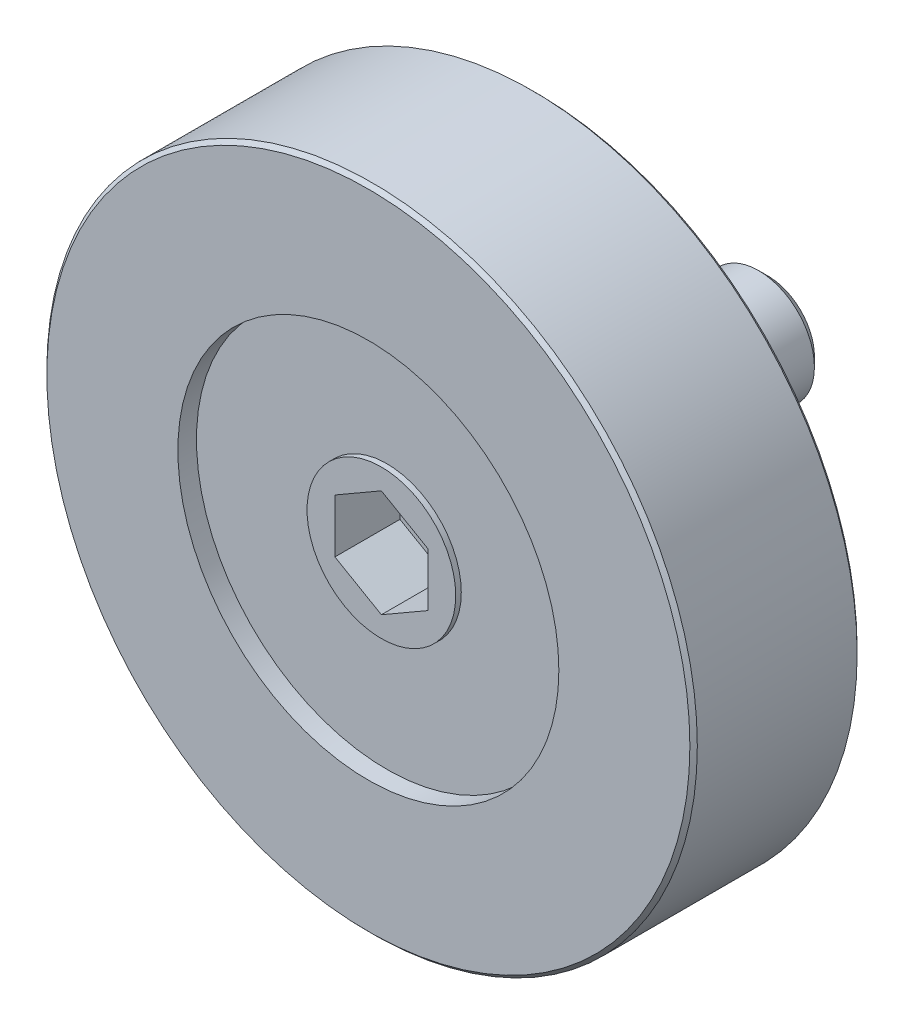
ISO-10303-21;
HEADER;
FILE_DESCRIPTION(('STEP AP214'),'2;1');
FILE_NAME('part.step','',(''),(''),'','','');
FILE_SCHEMA(('AUTOMOTIVE_DESIGN { 1 0 10303 214 1 1 1 1 }'));
ENDSEC;
DATA;
#1=APPLICATION_CONTEXT('core data for automotive mechanical design processes');
#2=APPLICATION_PROTOCOL_DEFINITION('international standard','automotive_design',2000,#1);
#3=PRODUCT_CONTEXT('',#1,'mechanical');
#4=PRODUCT('Part','Part','',(#3));
#5=PRODUCT_RELATED_PRODUCT_CATEGORY('part','',(#4));
#6=PRODUCT_DEFINITION_FORMATION('','',#4);
#7=PRODUCT_DEFINITION_CONTEXT('part definition',#1,'design');
#8=PRODUCT_DEFINITION('design','',#6,#7);
#9=PRODUCT_DEFINITION_SHAPE('','',#8);
#10=(LENGTH_UNIT() NAMED_UNIT(*) SI_UNIT(.MILLI.,.METRE.));
#11=(NAMED_UNIT(*) PLANE_ANGLE_UNIT() SI_UNIT($,.RADIAN.));
#12=(NAMED_UNIT(*) SI_UNIT($,.STERADIAN.) SOLID_ANGLE_UNIT());
#13=UNCERTAINTY_MEASURE_WITH_UNIT(LENGTH_MEASURE(1.E-05),#10,'distance_accuracy_value','');
#14=(GEOMETRIC_REPRESENTATION_CONTEXT(3) GLOBAL_UNCERTAINTY_ASSIGNED_CONTEXT((#13)) GLOBAL_UNIT_ASSIGNED_CONTEXT((#10,
#11,#12)) REPRESENTATION_CONTEXT('',''));
#15=CARTESIAN_POINT('',(0.,0.,0.));
#16=DIRECTION('',(0.,0.,1.));
#17=DIRECTION('',(1.,0.,0.));
#18=AXIS2_PLACEMENT_3D('',#15,#16,#17);
#19=CARTESIAN_POINT('',(0.,2.35,-1.5));
#20=DIRECTION('',(0.,0.,1.));
#21=DIRECTION('',(1.,0.,0.));
#22=AXIS2_PLACEMENT_3D('',#19,#20,#21);
#23=PLANE('',#22);
#24=CARTESIAN_POINT('',(0.,0.,-1.5));
#25=DIRECTION('',(0.,0.,1.));
#26=DIRECTION('',(1.,0.,0.));
#27=AXIS2_PLACEMENT_3D('',#24,#25,#26);
#28=CIRCLE('',#27,3.);
#29=CARTESIAN_POINT('',(3.,0.,-1.5));
#30=VERTEX_POINT('',#29);
#31=EDGE_CURVE('E107',#30,#30,#28,.T.);
#32=ORIENTED_EDGE('',*,*,#31,.T.);
#33=EDGE_LOOP('',(#32));
#34=FACE_BOUND('',#33,.T.);
#35=CARTESIAN_POINT('',(0.,0.,-1.5));
#36=DIRECTION('',(0.,0.,1.));
#37=DIRECTION('',(1.,0.,0.));
#38=AXIS2_PLACEMENT_3D('',#35,#36,#37);
#39=CIRCLE('',#38,2.35);
#40=CARTESIAN_POINT('',(2.35,0.,-1.5));
#41=VERTEX_POINT('',#40);
#42=EDGE_CURVE('E130',#41,#41,#39,.T.);
#43=ORIENTED_EDGE('',*,*,#42,.F.);
#44=EDGE_LOOP('',(#43));
#45=FACE_BOUND('',#44,.T.);
#46=ADVANCED_FACE('F14',(#34,#45),#23,.T.);
#47=CARTESIAN_POINT('',(0.,0.,13.5));
#48=DIRECTION('',(0.,0.,1.));
#49=DIRECTION('',(1.,0.,0.));
#50=AXIS2_PLACEMENT_3D('',#47,#48,#49);
#51=CYLINDRICAL_SURFACE('',#50,2.35);
#52=ORIENTED_EDGE('',*,*,#42,.T.);
#53=EDGE_LOOP('',(#52));
#54=FACE_BOUND('',#53,.T.);
#55=CARTESIAN_POINT('',(0.,0.,0.5));
#56=DIRECTION('',(0.,0.,1.));
#57=DIRECTION('',(1.,0.,0.));
#58=AXIS2_PLACEMENT_3D('',#55,#56,#57);
#59=CIRCLE('',#58,2.35);
#60=CARTESIAN_POINT('',(2.35,0.,0.5));
#61=VERTEX_POINT('',#60);
#62=EDGE_CURVE('E127',#61,#61,#59,.T.);
#63=ORIENTED_EDGE('',*,*,#62,.F.);
#64=EDGE_LOOP('',(#63));
#65=FACE_BOUND('',#64,.T.);
#66=ADVANCED_FACE('F161',(#54,#65),#51,.T.);
#67=CARTESIAN_POINT('',(0.,5.1,0.5));
#68=DIRECTION('',(0.,0.,-1.));
#69=DIRECTION('',(-1.,0.,0.));
#70=AXIS2_PLACEMENT_3D('',#67,#68,#69);
#71=PLANE('',#70);
#72=ORIENTED_EDGE('',*,*,#62,.T.);
#73=EDGE_LOOP('',(#72));
#74=FACE_BOUND('',#73,.T.);
#75=CARTESIAN_POINT('',(0.,0.,0.5));
#76=DIRECTION('',(0.,0.,1.));
#77=DIRECTION('',(1.,0.,0.));
#78=AXIS2_PLACEMENT_3D('',#75,#76,#77);
#79=CIRCLE('',#78,5.1);
#80=CARTESIAN_POINT('',(5.1,0.,0.5));
#81=VERTEX_POINT('',#80);
#82=EDGE_CURVE('E124',#81,#81,#79,.T.);
#83=ORIENTED_EDGE('',*,*,#82,.F.);
#84=EDGE_LOOP('',(#83));
#85=FACE_BOUND('',#84,.T.);
#86=ADVANCED_FACE('F166',(#74,#85),#71,.T.);
#87=CARTESIAN_POINT('',(0.,0.,13.5));
#88=DIRECTION('',(0.,0.,1.));
#89=DIRECTION('',(1.,0.,0.));
#90=AXIS2_PLACEMENT_3D('',#87,#88,#89);
#91=CYLINDRICAL_SURFACE('',#90,5.1);
#92=ORIENTED_EDGE('',*,*,#82,.T.);
#93=EDGE_LOOP('',(#92));
#94=FACE_BOUND('',#93,.T.);
#95=CARTESIAN_POINT('',(0.,0.,2.));
#96=DIRECTION('',(0.,0.,1.));
#97=DIRECTION('',(1.,0.,0.));
#98=AXIS2_PLACEMENT_3D('',#95,#96,#97);
#99=CIRCLE('',#98,5.1);
#100=CARTESIAN_POINT('',(5.1,0.,2.));
#101=VERTEX_POINT('',#100);
#102=EDGE_CURVE('E180',#101,#101,#99,.T.);
#103=ORIENTED_EDGE('',*,*,#102,.F.);
#104=EDGE_LOOP('',(#103));
#105=FACE_BOUND('',#104,.T.);
#106=ADVANCED_FACE('F155',(#94,#105),#91,.T.);
#107=CARTESIAN_POINT('',(0.,0.,13.5));
#108=DIRECTION('',(0.,0.,1.));
#109=DIRECTION('',(1.,0.,0.));
#110=AXIS2_PLACEMENT_3D('',#107,#108,#109);
#111=CYLINDRICAL_SURFACE('',#110,3.);
#112=CARTESIAN_POINT('',(0.,0.,-11.));
#113=DIRECTION('',(0.,0.,-1.));
#114=DIRECTION('',(-1.,0.,0.));
#115=AXIS2_PLACEMENT_3D('',#112,#113,#114);
#116=CIRCLE('',#115,3.);
#117=CARTESIAN_POINT('',(-3.,0.,-11.));
#118=VERTEX_POINT('',#117);
#119=EDGE_CURVE('E9',#118,#118,#116,.F.);
#120=ORIENTED_EDGE('',*,*,#119,.T.);
#121=EDGE_LOOP('',(#120));
#122=FACE_BOUND('',#121,.T.);
#123=ORIENTED_EDGE('',*,*,#31,.F.);
#124=EDGE_LOOP('',(#123));
#125=FACE_BOUND('',#124,.T.);
#126=ADVANCED_FACE('F149',(#122,#125),#111,.T.);
#127=CARTESIAN_POINT('',(0.,0.,-11.5));
#128=DIRECTION('',(0.,0.,-1.));
#129=DIRECTION('',(-1.,0.,0.));
#130=AXIS2_PLACEMENT_3D('',#127,#128,#129);
#131=PLANE('',#130);
#132=CARTESIAN_POINT('',(0.,0.,-11.5));
#133=DIRECTION('',(0.,0.,-1.));
#134=DIRECTION('',(-1.,0.,0.));
#135=AXIS2_PLACEMENT_3D('',#132,#133,#134);
#136=CIRCLE('',#135,2.5);
#137=CARTESIAN_POINT('',(-2.5,0.,-11.5));
#138=VERTEX_POINT('',#137);
#139=EDGE_CURVE('E23',#138,#138,#136,.T.);
#140=ORIENTED_EDGE('',*,*,#139,.T.);
#141=EDGE_LOOP('',(#140));
#142=FACE_BOUND('',#141,.T.);
#143=ADVANCED_FACE('F135',(#142),#131,.T.);
#144=CARTESIAN_POINT('',(0.,0.,-11.5));
#145=DIRECTION('',(0.,0.,1.));
#146=DIRECTION('',(1.,0.,0.));
#147=AXIS2_PLACEMENT_3D('',#144,#145,#146);
#148=CONICAL_SURFACE('',#147,2.5,0.785398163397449);
#149=ORIENTED_EDGE('',*,*,#119,.F.);
#150=EDGE_LOOP('',(#149));
#151=FACE_BOUND('',#150,.T.);
#152=ORIENTED_EDGE('',*,*,#139,.F.);
#153=EDGE_LOOP('',(#152));
#154=FACE_BOUND('',#153,.T.);
#155=ADVANCED_FACE('F16',(#151,#154),#148,.T.);
#156=CARTESIAN_POINT('',(0.,0.,5.8));
#157=DIRECTION('',(0.,0.,1.));
#158=DIRECTION('',(1.,0.,0.));
#159=AXIS2_PLACEMENT_3D('',#156,#157,#158);
#160=PLANE('',#159);
#161=DIRECTION('',(-0.866025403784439,0.5,0.));
#162=VECTOR('',#161,1.);
#163=CARTESIAN_POINT('',(2.5,1.44337567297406,5.8));
#164=LINE('',#163,#162);
#165=CARTESIAN_POINT('',(2.5,1.44337567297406,5.8));
#166=VERTEX_POINT('',#165);
#167=CARTESIAN_POINT('',(0.,2.88675134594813,5.8));
#168=VERTEX_POINT('',#167);
#169=EDGE_CURVE('E98',#166,#168,#164,.T.);
#170=ORIENTED_EDGE('',*,*,#169,.T.);
#171=DIRECTION('',(-0.866025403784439,-0.5,0.));
#172=VECTOR('',#171,1.);
#173=CARTESIAN_POINT('',(0.,2.88675134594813,5.8));
#174=LINE('',#173,#172);
#175=CARTESIAN_POINT('',(-2.5,1.44337567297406,5.8));
#176=VERTEX_POINT('',#175);
#177=EDGE_CURVE('E117',#168,#176,#174,.T.);
#178=ORIENTED_EDGE('',*,*,#177,.T.);
#179=DIRECTION('',(0.,-1.,0.));
#180=VECTOR('',#179,1.);
#181=CARTESIAN_POINT('',(-2.5,1.44337567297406,5.8));
#182=LINE('',#181,#180);
#183=CARTESIAN_POINT('',(-2.5,-1.44337567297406,5.8));
#184=VERTEX_POINT('',#183);
#185=EDGE_CURVE('E114',#176,#184,#182,.T.);
#186=ORIENTED_EDGE('',*,*,#185,.T.);
#187=DIRECTION('',(0.866025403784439,-0.5,0.));
#188=VECTOR('',#187,1.);
#189=CARTESIAN_POINT('',(-2.5,-1.44337567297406,5.8));
#190=LINE('',#189,#188);
#191=CARTESIAN_POINT('',(0.,-2.88675134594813,5.8));
#192=VERTEX_POINT('',#191);
#193=EDGE_CURVE('E112',#184,#192,#190,.T.);
#194=ORIENTED_EDGE('',*,*,#193,.T.);
#195=DIRECTION('',(0.866025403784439,0.5,0.));
#196=VECTOR('',#195,1.);
#197=CARTESIAN_POINT('',(0.,-2.88675134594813,5.8));
#198=LINE('',#197,#196);
#199=CARTESIAN_POINT('',(2.5,-1.44337567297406,5.8));
#200=VERTEX_POINT('',#199);
#201=EDGE_CURVE('E79',#192,#200,#198,.T.);
#202=ORIENTED_EDGE('',*,*,#201,.T.);
#203=DIRECTION('',(0.,1.,0.));
#204=VECTOR('',#203,1.);
#205=CARTESIAN_POINT('',(2.5,-1.44337567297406,5.8));
#206=LINE('',#205,#204);
#207=EDGE_CURVE('E108',#200,#166,#206,.T.);
#208=ORIENTED_EDGE('',*,*,#207,.T.);
#209=EDGE_LOOP('',(#170,#178,#186,#194,#202,#208));
#210=FACE_BOUND('',#209,.T.);
#211=ADVANCED_FACE('F138',(#210),#160,.T.);
#212=CARTESIAN_POINT('',(0.,2.88675134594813,5.8));
#213=DIRECTION('',(-0.5,0.866025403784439,0.));
#214=DIRECTION('',(-0.866025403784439,-0.5,0.));
#215=AXIS2_PLACEMENT_3D('',#212,#213,#214);
#216=PLANE('',#215);
#217=DIRECTION('',(-0.866025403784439,-0.5,0.));
#218=VECTOR('',#217,1.);
#219=CARTESIAN_POINT('',(0.,2.88675134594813,9.3));
#220=LINE('',#219,#218);
#221=CARTESIAN_POINT('',(0.,2.88675134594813,9.3));
#222=VERTEX_POINT('',#221);
#223=CARTESIAN_POINT('',(-2.5,1.44337567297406,9.3));
#224=VERTEX_POINT('',#223);
#225=EDGE_CURVE('E103',#222,#224,#220,.T.);
#226=ORIENTED_EDGE('',*,*,#225,.T.);
#227=DIRECTION('',(0.,0.,1.));
#228=VECTOR('',#227,1.);
#229=CARTESIAN_POINT('',(-2.5,1.44337567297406,5.8));
#230=LINE('',#229,#228);
#231=EDGE_CURVE('E31',#176,#224,#230,.T.);
#232=ORIENTED_EDGE('',*,*,#231,.F.);
#233=ORIENTED_EDGE('',*,*,#177,.F.);
#234=DIRECTION('',(0.,0.,1.));
#235=VECTOR('',#234,1.);
#236=CARTESIAN_POINT('',(0.,2.88675134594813,5.8));
#237=LINE('',#236,#235);
#238=EDGE_CURVE('E59',#168,#222,#237,.T.);
#239=ORIENTED_EDGE('',*,*,#238,.T.);
#240=EDGE_LOOP('',(#226,#232,#233,#239));
#241=FACE_BOUND('',#240,.T.);
#242=ADVANCED_FACE('F146',(#241),#216,.F.);
#243=CARTESIAN_POINT('',(-2.5,1.44337567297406,5.8));
#244=DIRECTION('',(-1.,0.,0.));
#245=DIRECTION('',(0.,-1.,0.));
#246=AXIS2_PLACEMENT_3D('',#243,#244,#245);
#247=PLANE('',#246);
#248=DIRECTION('',(0.,-1.,0.));
#249=VECTOR('',#248,1.);
#250=CARTESIAN_POINT('',(-2.5,1.44337567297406,9.3));
#251=LINE('',#250,#249);
#252=CARTESIAN_POINT('',(-2.5,-1.44337567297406,9.3));
#253=VERTEX_POINT('',#252);
#254=EDGE_CURVE('E91',#224,#253,#251,.T.);
#255=ORIENTED_EDGE('',*,*,#254,.T.);
#256=DIRECTION('',(0.,0.,1.));
#257=VECTOR('',#256,1.);
#258=CARTESIAN_POINT('',(-2.5,-1.44337567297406,5.8));
#259=LINE('',#258,#257);
#260=EDGE_CURVE('E83',#184,#253,#259,.T.);
#261=ORIENTED_EDGE('',*,*,#260,.F.);
#262=ORIENTED_EDGE('',*,*,#185,.F.);
#263=ORIENTED_EDGE('',*,*,#231,.T.);
#264=EDGE_LOOP('',(#255,#261,#262,#263));
#265=FACE_BOUND('',#264,.T.);
#266=ADVANCED_FACE('F220',(#265),#247,.F.);
#267=CARTESIAN_POINT('',(-2.5,-1.44337567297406,5.8));
#268=DIRECTION('',(-0.5,-0.866025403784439,0.));
#269=DIRECTION('',(0.866025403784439,-0.5,0.));
#270=AXIS2_PLACEMENT_3D('',#267,#268,#269);
#271=PLANE('',#270);
#272=DIRECTION('',(0.866025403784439,-0.5,0.));
#273=VECTOR('',#272,1.);
#274=CARTESIAN_POINT('',(-2.5,-1.44337567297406,9.3));
#275=LINE('',#274,#273);
#276=CARTESIAN_POINT('',(0.,-2.88675134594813,9.3));
#277=VERTEX_POINT('',#276);
#278=EDGE_CURVE('E87',#253,#277,#275,.T.);
#279=ORIENTED_EDGE('',*,*,#278,.T.);
#280=DIRECTION('',(0.,0.,1.));
#281=VECTOR('',#280,1.);
#282=CARTESIAN_POINT('',(0.,-2.88675134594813,5.8));
#283=LINE('',#282,#281);
#284=EDGE_CURVE('E72',#192,#277,#283,.T.);
#285=ORIENTED_EDGE('',*,*,#284,.F.);
#286=ORIENTED_EDGE('',*,*,#193,.F.);
#287=ORIENTED_EDGE('',*,*,#260,.T.);
#288=EDGE_LOOP('',(#279,#285,#286,#287));
#289=FACE_BOUND('',#288,.T.);
#290=ADVANCED_FACE('F88',(#289),#271,.F.);
#291=CARTESIAN_POINT('',(0.,-2.88675134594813,5.8));
#292=DIRECTION('',(0.5,-0.866025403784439,0.));
#293=DIRECTION('',(0.866025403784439,0.5,0.));
#294=AXIS2_PLACEMENT_3D('',#291,#292,#293);
#295=PLANE('',#294);
#296=DIRECTION('',(0.866025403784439,0.5,0.));
#297=VECTOR('',#296,1.);
#298=CARTESIAN_POINT('',(0.,-2.88675134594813,9.3));
#299=LINE('',#298,#297);
#300=CARTESIAN_POINT('',(2.5,-1.44337567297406,9.3));
#301=VERTEX_POINT('',#300);
#302=EDGE_CURVE('E76',#277,#301,#299,.T.);
#303=ORIENTED_EDGE('',*,*,#302,.T.);
#304=DIRECTION('',(0.,0.,1.));
#305=VECTOR('',#304,1.);
#306=CARTESIAN_POINT('',(2.5,-1.44337567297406,5.8));
#307=LINE('',#306,#305);
#308=EDGE_CURVE('E84',#200,#301,#307,.T.);
#309=ORIENTED_EDGE('',*,*,#308,.F.);
#310=ORIENTED_EDGE('',*,*,#201,.F.);
#311=ORIENTED_EDGE('',*,*,#284,.T.);
#312=EDGE_LOOP('',(#303,#309,#310,#311));
#313=FACE_BOUND('',#312,.T.);
#314=ADVANCED_FACE('F74',(#313),#295,.F.);
#315=CARTESIAN_POINT('',(2.5,-1.44337567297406,5.8));
#316=DIRECTION('',(1.,0.,0.));
#317=DIRECTION('',(0.,0.,-1.));
#318=AXIS2_PLACEMENT_3D('',#315,#316,#317);
#319=PLANE('',#318);
#320=DIRECTION('',(0.,1.,0.));
#321=VECTOR('',#320,1.);
#322=CARTESIAN_POINT('',(2.5,-1.44337567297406,9.3));
#323=LINE('',#322,#321);
#324=CARTESIAN_POINT('',(2.5,1.44337567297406,9.3));
#325=VERTEX_POINT('',#324);
#326=EDGE_CURVE('E96',#301,#325,#323,.T.);
#327=ORIENTED_EDGE('',*,*,#326,.T.);
#328=DIRECTION('',(0.,0.,1.));
#329=VECTOR('',#328,1.);
#330=CARTESIAN_POINT('',(2.5,1.44337567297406,5.8));
#331=LINE('',#330,#329);
#332=EDGE_CURVE('E63',#166,#325,#331,.T.);
#333=ORIENTED_EDGE('',*,*,#332,.F.);
#334=ORIENTED_EDGE('',*,*,#207,.F.);
#335=ORIENTED_EDGE('',*,*,#308,.T.);
#336=EDGE_LOOP('',(#327,#333,#334,#335));
#337=FACE_BOUND('',#336,.T.);
#338=ADVANCED_FACE('F219',(#337),#319,.F.);
#339=CARTESIAN_POINT('',(2.5,1.44337567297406,5.8));
#340=DIRECTION('',(0.5,0.866025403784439,0.));
#341=DIRECTION('',(-0.866025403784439,0.5,0.));
#342=AXIS2_PLACEMENT_3D('',#339,#340,#341);
#343=PLANE('',#342);
#344=DIRECTION('',(-0.866025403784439,0.5,0.));
#345=VECTOR('',#344,1.);
#346=CARTESIAN_POINT('',(2.5,1.44337567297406,9.3));
#347=LINE('',#346,#345);
#348=EDGE_CURVE('E105',#325,#222,#347,.T.);
#349=ORIENTED_EDGE('',*,*,#348,.T.);
#350=ORIENTED_EDGE('',*,*,#238,.F.);
#351=ORIENTED_EDGE('',*,*,#169,.F.);
#352=ORIENTED_EDGE('',*,*,#332,.T.);
#353=EDGE_LOOP('',(#349,#350,#351,#352));
#354=FACE_BOUND('',#353,.T.);
#355=ADVANCED_FACE('F222',(#354),#343,.F.);
#356=CARTESIAN_POINT('',(0.,4.00000000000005,9.3));
#357=DIRECTION('',(0.,0.,1.));
#358=DIRECTION('',(1.,0.,0.));
#359=AXIS2_PLACEMENT_3D('',#356,#357,#358);
#360=PLANE('',#359);
#361=ORIENTED_EDGE('',*,*,#348,.F.);
#362=ORIENTED_EDGE('',*,*,#326,.F.);
#363=ORIENTED_EDGE('',*,*,#302,.F.);
#364=ORIENTED_EDGE('',*,*,#278,.F.);
#365=ORIENTED_EDGE('',*,*,#254,.F.);
#366=ORIENTED_EDGE('',*,*,#225,.F.);
#367=EDGE_LOOP('',(#361,#362,#363,#364,#365,#366));
#368=FACE_BOUND('',#367,.T.);
#369=CARTESIAN_POINT('',(0.,0.,9.3));
#370=DIRECTION('',(0.,0.,1.));
#371=DIRECTION('',(1.,0.,0.));
#372=AXIS2_PLACEMENT_3D('',#369,#370,#371);
#373=CIRCLE('',#372,4.00000000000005);
#374=CARTESIAN_POINT('',(4.00000000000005,0.,9.3));
#375=VERTEX_POINT('',#374);
#376=EDGE_CURVE('E211',#375,#375,#373,.T.);
#377=ORIENTED_EDGE('',*,*,#376,.T.);
#378=EDGE_LOOP('',(#377));
#379=FACE_BOUND('',#378,.T.);
#380=ADVANCED_FACE('F94',(#368,#379),#360,.T.);
#381=CARTESIAN_POINT('',(0.,0.,13.));
#382=DIRECTION('',(0.,0.,1.));
#383=DIRECTION('',(1.,0.,0.));
#384=AXIS2_PLACEMENT_3D('',#381,#382,#383);
#385=CYLINDRICAL_SURFACE('',#384,4.00000000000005);
#386=CARTESIAN_POINT('',(0.,0.,9.));
#387=DIRECTION('',(0.,0.,1.));
#388=DIRECTION('',(1.,0.,0.));
#389=AXIS2_PLACEMENT_3D('',#386,#387,#388);
#390=CIRCLE('',#389,4.00000000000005);
#391=CARTESIAN_POINT('',(4.00000000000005,0.,9.));
#392=VERTEX_POINT('',#391);
#393=EDGE_CURVE('E208',#392,#392,#390,.T.);
#394=ORIENTED_EDGE('',*,*,#393,.T.);
#395=EDGE_LOOP('',(#394));
#396=FACE_BOUND('',#395,.T.);
#397=ORIENTED_EDGE('',*,*,#376,.F.);
#398=EDGE_LOOP('',(#397));
#399=FACE_BOUND('',#398,.T.);
#400=ADVANCED_FACE('F230',(#396,#399),#385,.T.);
#401=CARTESIAN_POINT('',(0.,10.25,9.));
#402=DIRECTION('',(0.,0.,1.));
#403=DIRECTION('',(1.,0.,0.));
#404=AXIS2_PLACEMENT_3D('',#401,#402,#403);
#405=PLANE('',#404);
#406=CARTESIAN_POINT('',(0.,0.,9.));
#407=DIRECTION('',(0.,0.,1.));
#408=DIRECTION('',(1.,0.,0.));
#409=AXIS2_PLACEMENT_3D('',#406,#407,#408);
#410=CIRCLE('',#409,10.25);
#411=CARTESIAN_POINT('',(10.25,0.,9.));
#412=VERTEX_POINT('',#411);
#413=EDGE_CURVE('E205',#412,#412,#410,.T.);
#414=ORIENTED_EDGE('',*,*,#413,.T.);
#415=EDGE_LOOP('',(#414));
#416=FACE_BOUND('',#415,.T.);
#417=ORIENTED_EDGE('',*,*,#393,.F.);
#418=EDGE_LOOP('',(#417));
#419=FACE_BOUND('',#418,.T.);
#420=ADVANCED_FACE('F335',(#416,#419),#405,.T.);
#421=CARTESIAN_POINT('',(0.,0.,13.));
#422=DIRECTION('',(0.,0.,1.));
#423=DIRECTION('',(1.,0.,0.));
#424=AXIS2_PLACEMENT_3D('',#421,#422,#423);
#425=CYLINDRICAL_SURFACE('',#424,10.25);
#426=CARTESIAN_POINT('',(0.,0.,10.));
#427=DIRECTION('',(0.,0.,1.));
#428=DIRECTION('',(1.,0.,0.));
#429=AXIS2_PLACEMENT_3D('',#426,#427,#428);
#430=CIRCLE('',#429,10.25);
#431=CARTESIAN_POINT('',(10.25,0.,10.));
#432=VERTEX_POINT('',#431);
#433=EDGE_CURVE('E202',#432,#432,#430,.T.);
#434=ORIENTED_EDGE('',*,*,#433,.T.);
#435=EDGE_LOOP('',(#434));
#436=FACE_BOUND('',#435,.T.);
#437=ORIENTED_EDGE('',*,*,#413,.F.);
#438=EDGE_LOOP('',(#437));
#439=FACE_BOUND('',#438,.T.);
#440=ADVANCED_FACE('F342',(#436,#439),#425,.F.);
#441=CARTESIAN_POINT('',(0.,17.3,10.));
#442=DIRECTION('',(0.,0.,1.));
#443=DIRECTION('',(1.,0.,0.));
#444=AXIS2_PLACEMENT_3D('',#441,#442,#443);
#445=PLANE('',#444);
#446=CARTESIAN_POINT('',(0.,0.,9.99999999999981));
#447=DIRECTION('',(0.,0.,1.));
#448=DIRECTION('',(1.,0.,0.));
#449=AXIS2_PLACEMENT_3D('',#446,#447,#448);
#450=CIRCLE('',#449,17.3);
#451=CARTESIAN_POINT('',(17.3,0.,9.99999999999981));
#452=VERTEX_POINT('',#451);
#453=EDGE_CURVE('E199',#452,#452,#450,.T.);
#454=ORIENTED_EDGE('',*,*,#453,.T.);
#455=EDGE_LOOP('',(#454));
#456=FACE_BOUND('',#455,.T.);
#457=ORIENTED_EDGE('',*,*,#433,.F.);
#458=EDGE_LOOP('',(#457));
#459=FACE_BOUND('',#458,.T.);
#460=ADVANCED_FACE('F350',(#456,#459),#445,.T.);
#461=CARTESIAN_POINT('',(0.,0.,9.99999999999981));
#462=DIRECTION('',(0.,0.,-1.));
#463=DIRECTION('',(-1.,0.,0.));
#464=AXIS2_PLACEMENT_3D('',#461,#462,#463);
#465=CONICAL_SURFACE('',#464,17.3,0.785398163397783);
#466=CARTESIAN_POINT('',(0.,0.,9.8));
#467=DIRECTION('',(0.,0.,1.));
#468=DIRECTION('',(1.,0.,0.));
#469=AXIS2_PLACEMENT_3D('',#466,#467,#468);
#470=CIRCLE('',#469,17.5);
#471=CARTESIAN_POINT('',(17.5,0.,9.8));
#472=VERTEX_POINT('',#471);
#473=EDGE_CURVE('E196',#472,#472,#470,.T.);
#474=ORIENTED_EDGE('',*,*,#473,.T.);
#475=EDGE_LOOP('',(#474));
#476=FACE_BOUND('',#475,.T.);
#477=ORIENTED_EDGE('',*,*,#453,.F.);
#478=EDGE_LOOP('',(#477));
#479=FACE_BOUND('',#478,.T.);
#480=ADVANCED_FACE('F358',(#476,#479),#465,.T.);
#481=CARTESIAN_POINT('',(0.,0.,13.));
#482=DIRECTION('',(0.,0.,1.));
#483=DIRECTION('',(1.,0.,0.));
#484=AXIS2_PLACEMENT_3D('',#481,#482,#483);
#485=CYLINDRICAL_SURFACE('',#484,17.5);
#486=CARTESIAN_POINT('',(0.,0.,1.2));
#487=DIRECTION('',(0.,0.,1.));
#488=DIRECTION('',(1.,0.,0.));
#489=AXIS2_PLACEMENT_3D('',#486,#487,#488);
#490=CIRCLE('',#489,17.5);
#491=CARTESIAN_POINT('',(17.5,0.,1.2));
#492=VERTEX_POINT('',#491);
#493=EDGE_CURVE('E193',#492,#492,#490,.T.);
#494=ORIENTED_EDGE('',*,*,#493,.T.);
#495=EDGE_LOOP('',(#494));
#496=FACE_BOUND('',#495,.T.);
#497=ORIENTED_EDGE('',*,*,#473,.F.);
#498=EDGE_LOOP('',(#497));
#499=FACE_BOUND('',#498,.T.);
#500=ADVANCED_FACE('F366',(#496,#499),#485,.T.);
#501=CARTESIAN_POINT('',(0.,0.,1.2));
#502=DIRECTION('',(0.,0.,1.));
#503=DIRECTION('',(1.,0.,0.));
#504=AXIS2_PLACEMENT_3D('',#501,#502,#503);
#505=CONICAL_SURFACE('',#504,17.5,0.785398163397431);
#506=CARTESIAN_POINT('',(0.,0.,1.));
#507=DIRECTION('',(0.,0.,1.));
#508=DIRECTION('',(1.,0.,0.));
#509=AXIS2_PLACEMENT_3D('',#506,#507,#508);
#510=CIRCLE('',#509,17.3);
#511=CARTESIAN_POINT('',(17.3,0.,1.));
#512=VERTEX_POINT('',#511);
#513=EDGE_CURVE('E190',#512,#512,#510,.T.);
#514=ORIENTED_EDGE('',*,*,#513,.T.);
#515=EDGE_LOOP('',(#514));
#516=FACE_BOUND('',#515,.T.);
#517=ORIENTED_EDGE('',*,*,#493,.F.);
#518=EDGE_LOOP('',(#517));
#519=FACE_BOUND('',#518,.T.);
#520=ADVANCED_FACE('F374',(#516,#519),#505,.T.);
#521=CARTESIAN_POINT('',(0.,17.3,1.));
#522=DIRECTION('',(0.,0.,-1.));
#523=DIRECTION('',(-1.,0.,0.));
#524=AXIS2_PLACEMENT_3D('',#521,#522,#523);
#525=PLANE('',#524);
#526=CARTESIAN_POINT('',(0.,0.,1.));
#527=DIRECTION('',(0.,0.,1.));
#528=DIRECTION('',(1.,0.,0.));
#529=AXIS2_PLACEMENT_3D('',#526,#527,#528);
#530=CIRCLE('',#529,10.25);
#531=CARTESIAN_POINT('',(10.25,0.,1.));
#532=VERTEX_POINT('',#531);
#533=EDGE_CURVE('E185',#532,#532,#530,.T.);
#534=ORIENTED_EDGE('',*,*,#533,.T.);
#535=EDGE_LOOP('',(#534));
#536=FACE_BOUND('',#535,.T.);
#537=ORIENTED_EDGE('',*,*,#513,.F.);
#538=EDGE_LOOP('',(#537));
#539=FACE_BOUND('',#538,.T.);
#540=ADVANCED_FACE('F382',(#536,#539),#525,.T.);
#541=CARTESIAN_POINT('',(0.,0.,13.));
#542=DIRECTION('',(0.,0.,1.));
#543=DIRECTION('',(1.,0.,0.));
#544=AXIS2_PLACEMENT_3D('',#541,#542,#543);
#545=CYLINDRICAL_SURFACE('',#544,10.25);
#546=CARTESIAN_POINT('',(0.,0.,2.));
#547=DIRECTION('',(0.,0.,1.));
#548=DIRECTION('',(1.,0.,0.));
#549=AXIS2_PLACEMENT_3D('',#546,#547,#548);
#550=CIRCLE('',#549,10.25);
#551=CARTESIAN_POINT('',(10.25,0.,2.));
#552=VERTEX_POINT('',#551);
#553=EDGE_CURVE('E182',#552,#552,#550,.T.);
#554=ORIENTED_EDGE('',*,*,#553,.T.);
#555=EDGE_LOOP('',(#554));
#556=FACE_BOUND('',#555,.T.);
#557=ORIENTED_EDGE('',*,*,#533,.F.);
#558=EDGE_LOOP('',(#557));
#559=FACE_BOUND('',#558,.T.);
#560=ADVANCED_FACE('F390',(#556,#559),#545,.F.);
#561=CARTESIAN_POINT('',(0.,5.1,2.));
#562=DIRECTION('',(0.,0.,-1.));
#563=DIRECTION('',(-1.,0.,0.));
#564=AXIS2_PLACEMENT_3D('',#561,#562,#563);
#565=PLANE('',#564);
#566=ORIENTED_EDGE('',*,*,#102,.T.);
#567=EDGE_LOOP('',(#566));
#568=FACE_BOUND('',#567,.T.);
#569=ORIENTED_EDGE('',*,*,#553,.F.);
#570=EDGE_LOOP('',(#569));
#571=FACE_BOUND('',#570,.T.);
#572=ADVANCED_FACE('F398',(#568,#571),#565,.T.);
#573=CLOSED_SHELL('',(#46,#66,#86,#106,#126,#143,#155,#211,#242,#266,#290,#314,#338,#355,#380,
#400,#420,#440,#460,#480,#500,#520,#540,#560,#572));
#574=MANIFOLD_SOLID_BREP('B1',#573);
#575=ADVANCED_BREP_SHAPE_REPRESENTATION('',(#18,#574),#14);
#576=SHAPE_DEFINITION_REPRESENTATION(#9,#575);
ENDSEC;
END-ISO-10303-21;
